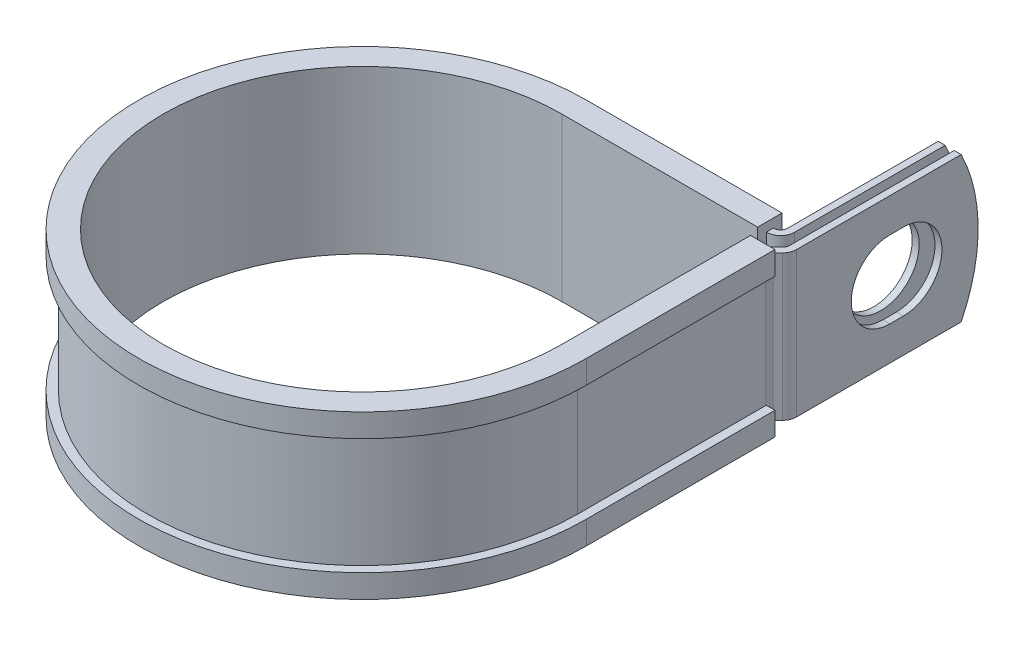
from build123d import *

# Parameters (mm, degrees)
EXTRUDE_THIN1_DEPTH = 12.7
SKETCH2_R           = 6.7437
CUT_EXTRUDE1_DEPTH  = 1.2192
CUT_EXTRUDE2_DEPTH  = 1.2192
CUT_EXTRUDE3_DEPTH  = 101.898918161


with BuildPart() as part:
    # Sketch1 → Extrude-Thin1 (new, symmetric)
    with BuildSketch(Plane(origin=(0, 0, 0), x_dir=(1, 0, 0), z_dir=(0, 1, 0))):
        with BuildLine():
            Line((38.3464698, 68.2498), (38.3464698, 36.449))
            ThreePointArc((38.3464698, 36.449), (38.253663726, 35.982432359), (37.989374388, 35.586895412))
            Line((37.989374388, 35.586895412), (37.163190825, 34.760711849))
            ThreePointArc((37.163190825, 34.760711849), (36.634612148, 33.969637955), (36.449, 33.036502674))
            Line((36.449, 33.036502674), (36.449, 0))
            ThreePointArc((36.449, 0), (-25.773335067, -25.773335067), (0, 36.449))
            Line((0, 36.449), (34.3332698, 36.449))
            ThreePointArc((34.3332698, 36.449), (36.057478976, 37.163190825), (36.7716698, 38.8874))
            Line((36.7716698, 38.8874), (36.7716698, 68.2498))
            Line((36.7716698, 68.2498), (35.5524698, 68.2498))
            Line((35.5524698, 68.2498), (35.5524698, 38.8874))
            ThreePointArc((35.5524698, 38.8874), (35.195374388, 38.025295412), (34.3332698, 37.6682))
            Line((34.3332698, 37.6682), (0, 37.6682))
            ThreePointArc((0, 37.6682), (-26.635439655, -26.635439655), (37.6682, 0))
            Line((37.6682, 0), (37.6682, 33.036502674))
            ThreePointArc((37.6682, 33.036502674), (37.761006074, 33.503070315), (38.025295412, 33.898607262))
            Line((38.025295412, 33.898607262), (38.851478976, 34.724790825))
            ThreePointArc((38.851478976, 34.724790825), (39.380057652, 35.515864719), (39.5656698, 36.449))
            Line((39.5656698, 36.449), (39.5656698, 68.2498))
            Line((39.5656698, 68.2498), (38.3464698, 68.2498))
        make_face()
    extrude(amount=EXTRUDE_THIN1_DEPTH, both=True)

    # Sketch2 → Cut-Extrude1 (cut)
    with BuildSketch(Plane.ZY.offset(-35.5524698)):
        with Locations((-53.975, 0)):
            Circle(SKETCH2_R)
    extrude(amount=-CUT_EXTRUDE1_DEPTH, mode=Mode.SUBTRACT)

    # Sketch3 → Cut-Extrude2 (cut)
    with BuildSketch(Plane(origin=(39.5656698, 0, 0), x_dir=(0, 0, -1), z_dir=(1, 0, 0))):
        with BuildLine():
            Line((52.7812, 6.7437), (55.1688, 6.7437))
            ThreePointArc((55.1688, 6.7437), (61.9125, 0), (55.1688, -6.7437))
            Line((55.1688, -6.7437), (52.7812, -6.7437))
            ThreePointArc((52.7812, -6.7437), (46.0375, 0), (52.7812, 6.7437))
        make_face()
    extrude(amount=-CUT_EXTRUDE2_DEPTH, mode=Mode.SUBTRACT)

    # Sketch4 → Cut-Extrude3 (cut, through all)
    with BuildSketch(Plane.ZY.offset(-35.5524698)):
        with BuildLine():
            Line((-65.272468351, 12.7), (-68.2498, 12.7))
            Line((-68.2498, 12.7), (-68.2498, 0))
            ThreePointArc((-68.2498, 0), (-67.495511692, 6.522164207), (-65.272468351, 12.7))
        make_face()
        with BuildLine():
            ThreePointArc((-65.272468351, -12.7), (-67.495511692, -6.522164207), (-68.2498, 0))
            Line((-68.2498, 0), (-68.2498, -12.7))
            Line((-68.2498, -12.7), (-65.272468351, -12.7))
        make_face()
    extrude(amount=-CUT_EXTRUDE3_DEPTH, mode=Mode.SUBTRACT)

    # Sweep1: sweep along a path in Sketch6
    with BuildLine(Plane(origin=(0, 12.7, 0), x_dir=(1, 0, 0), z_dir=(0, 1, 0))) as sweep1_path:
        Line((34.925, 33.036502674), (34.925, 0))
        ThreePointArc((34.925, 0), (-24.695704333, -24.695704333), (0, 34.925))
        Line((0, 34.925), (34.2824698, 34.925))
    # Sketch5 → Sweep1 (sweep)
    with BuildSketch(Plane(origin=(0, 0, -33.036502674), x_dir=(-1, 0, 0), z_dir=(0, 0, -1))):
        Polygon((-37.6682, 12.7), (-36.449, 12.7), (-36.449, -12.7), (-37.6682, -12.7), (-37.6682, -10.16), (-39.1922, -10.16), (-39.1922, -14.224), (-34.925, -14.224), (-34.925, 14.224), (-39.1922, 14.224), (-39.1922, 10.16), (-37.6682, 10.16), align=None)
    sweep(path=sweep1_path.line)


solid = part.part
